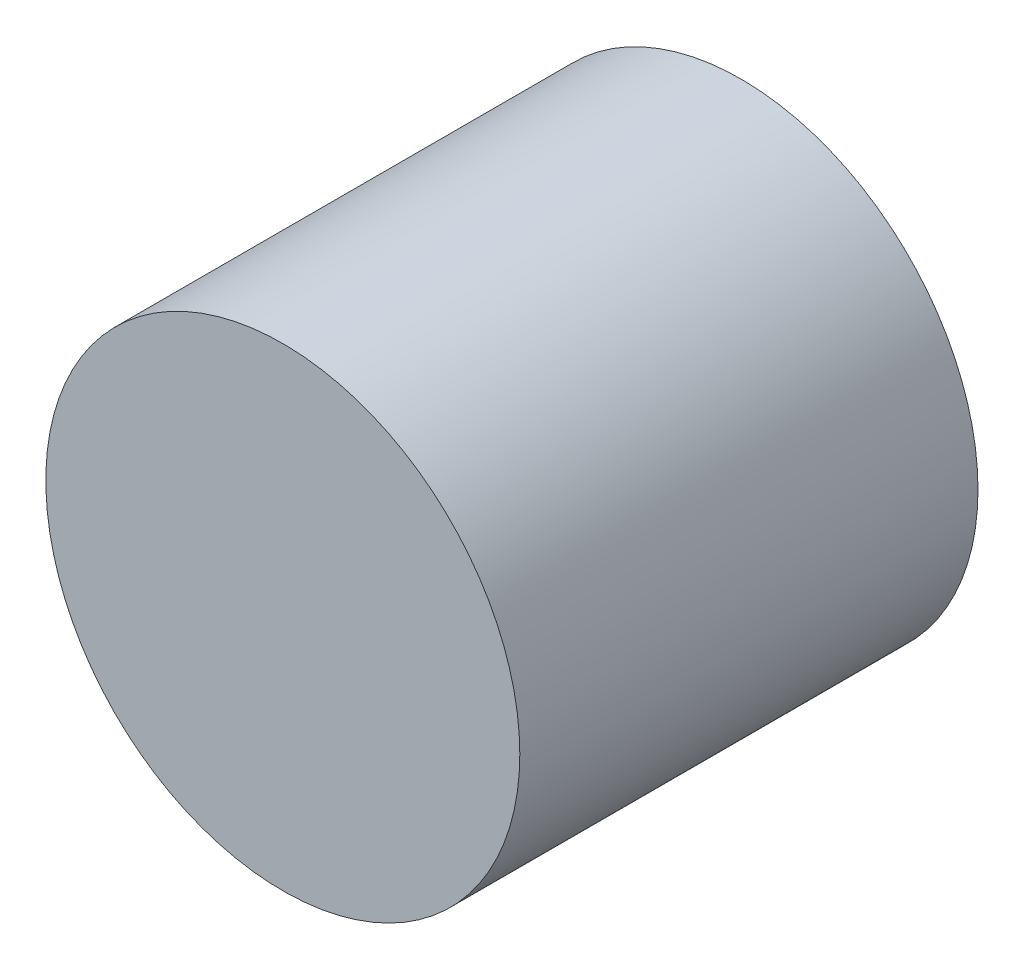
ISO-10303-21;
HEADER;
FILE_DESCRIPTION(('STEP AP214'),'2;1');
FILE_NAME('part.step','',(''),(''),'','','');
FILE_SCHEMA(('AUTOMOTIVE_DESIGN { 1 0 10303 214 1 1 1 1 }'));
ENDSEC;
DATA;
#1=APPLICATION_CONTEXT('core data for automotive mechanical design processes');
#2=APPLICATION_PROTOCOL_DEFINITION('international standard','automotive_design',2000,#1);
#3=PRODUCT_CONTEXT('',#1,'mechanical');
#4=PRODUCT('Part','Part','',(#3));
#5=PRODUCT_RELATED_PRODUCT_CATEGORY('part','',(#4));
#6=PRODUCT_DEFINITION_FORMATION('','',#4);
#7=PRODUCT_DEFINITION_CONTEXT('part definition',#1,'design');
#8=PRODUCT_DEFINITION('design','',#6,#7);
#9=PRODUCT_DEFINITION_SHAPE('','',#8);
#10=(LENGTH_UNIT() NAMED_UNIT(*) SI_UNIT(.MILLI.,.METRE.));
#11=(NAMED_UNIT(*) PLANE_ANGLE_UNIT() SI_UNIT($,.RADIAN.));
#12=(NAMED_UNIT(*) SI_UNIT($,.STERADIAN.) SOLID_ANGLE_UNIT());
#13=UNCERTAINTY_MEASURE_WITH_UNIT(LENGTH_MEASURE(1.E-05),#10,'distance_accuracy_value','');
#14=(GEOMETRIC_REPRESENTATION_CONTEXT(3) GLOBAL_UNCERTAINTY_ASSIGNED_CONTEXT((#13)) GLOBAL_UNIT_ASSIGNED_CONTEXT((#10,
#11,#12)) REPRESENTATION_CONTEXT('',''));
#15=CARTESIAN_POINT('',(0.,0.,0.));
#16=DIRECTION('',(0.,0.,1.));
#17=DIRECTION('',(1.,0.,0.));
#18=AXIS2_PLACEMENT_3D('',#15,#16,#17);
#19=CARTESIAN_POINT('',(0.,0.,0.));
#20=DIRECTION('',(0.,0.,1.));
#21=DIRECTION('',(1.,0.,0.));
#22=AXIS2_PLACEMENT_3D('',#19,#20,#21);
#23=PLANE('',#22);
#24=CARTESIAN_POINT('',(0.,0.,0.));
#25=DIRECTION('',(0.,0.,1.));
#26=DIRECTION('',(1.,0.,0.));
#27=AXIS2_PLACEMENT_3D('',#24,#25,#26);
#28=CIRCLE('',#27,15.);
#29=CARTESIAN_POINT('',(15.,0.,0.));
#30=VERTEX_POINT('',#29);
#31=EDGE_CURVE('E16',#30,#30,#28,.T.);
#32=ORIENTED_EDGE('',*,*,#31,.F.);
#33=EDGE_LOOP('',(#32));
#34=FACE_BOUND('',#33,.T.);
#35=ADVANCED_FACE('F12',(#34),#23,.F.);
#36=CARTESIAN_POINT('',(0.,0.,29.));
#37=DIRECTION('',(0.,0.,-1.));
#38=DIRECTION('',(-1.,0.,0.));
#39=AXIS2_PLACEMENT_3D('',#36,#37,#38);
#40=CYLINDRICAL_SURFACE('',#39,15.);
#41=CARTESIAN_POINT('',(0.,0.,29.));
#42=DIRECTION('',(0.,0.,1.));
#43=DIRECTION('',(1.,0.,0.));
#44=AXIS2_PLACEMENT_3D('',#41,#42,#43);
#45=CIRCLE('',#44,15.);
#46=CARTESIAN_POINT('',(15.,0.,29.));
#47=VERTEX_POINT('',#46);
#48=EDGE_CURVE('E8',#47,#47,#45,.T.);
#49=ORIENTED_EDGE('',*,*,#48,.F.);
#50=EDGE_LOOP('',(#49));
#51=FACE_BOUND('',#50,.T.);
#52=ORIENTED_EDGE('',*,*,#31,.T.);
#53=EDGE_LOOP('',(#52));
#54=FACE_BOUND('',#53,.T.);
#55=ADVANCED_FACE('F14',(#51,#54),#40,.T.);
#56=CARTESIAN_POINT('',(0.,0.,29.));
#57=DIRECTION('',(0.,0.,1.));
#58=DIRECTION('',(1.,0.,0.));
#59=AXIS2_PLACEMENT_3D('',#56,#57,#58);
#60=PLANE('',#59);
#61=ORIENTED_EDGE('',*,*,#48,.T.);
#62=EDGE_LOOP('',(#61));
#63=FACE_BOUND('',#62,.T.);
#64=ADVANCED_FACE('F32',(#63),#60,.T.);
#65=CLOSED_SHELL('',(#35,#55,#64));
#66=MANIFOLD_SOLID_BREP('B1',#65);
#67=ADVANCED_BREP_SHAPE_REPRESENTATION('',(#18,#66),#14);
#68=SHAPE_DEFINITION_REPRESENTATION(#9,#67);
ENDSEC;
END-ISO-10303-21;
